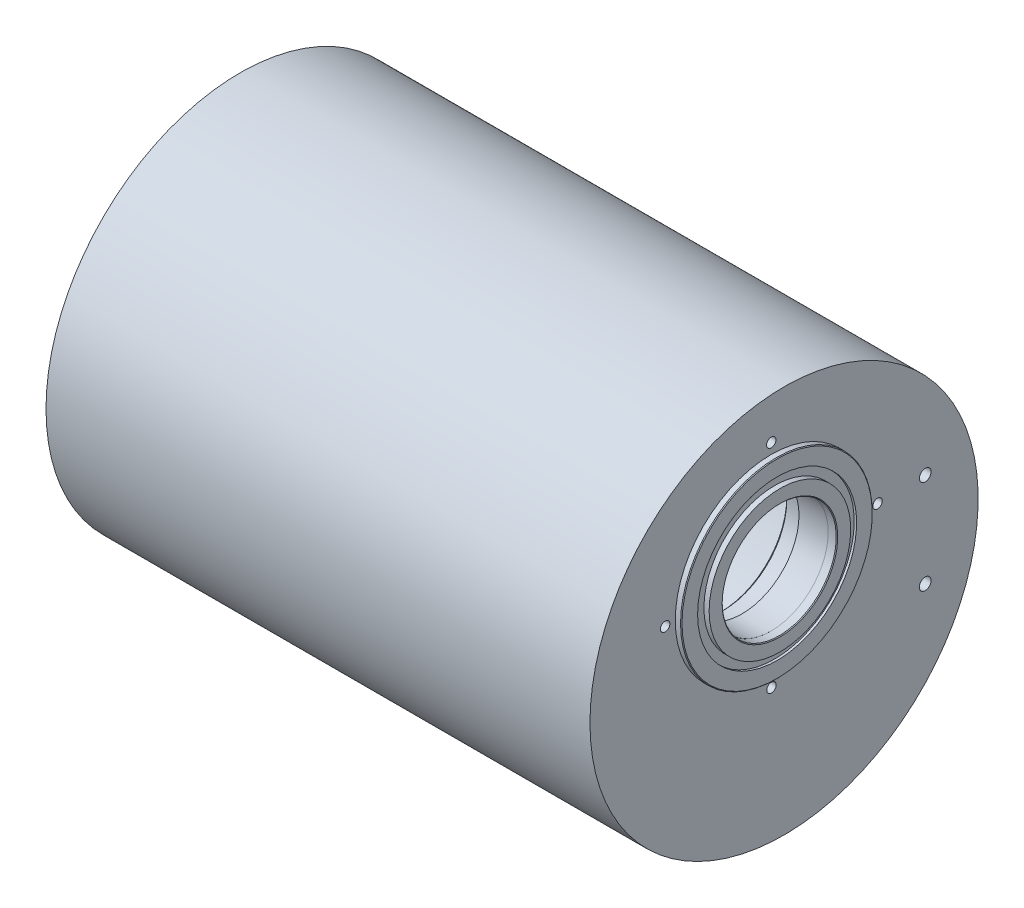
ISO-10303-21;
HEADER;
FILE_DESCRIPTION(('STEP AP214'),'2;1');
FILE_NAME('part.step','',(''),(''),'','','');
FILE_SCHEMA(('AUTOMOTIVE_DESIGN { 1 0 10303 214 1 1 1 1 }'));
ENDSEC;
DATA;
#1=APPLICATION_CONTEXT('core data for automotive mechanical design processes');
#2=APPLICATION_PROTOCOL_DEFINITION('international standard','automotive_design',2000,#1);
#3=PRODUCT_CONTEXT('',#1,'mechanical');
#4=PRODUCT('Part','Part','',(#3));
#5=PRODUCT_RELATED_PRODUCT_CATEGORY('part','',(#4));
#6=PRODUCT_DEFINITION_FORMATION('','',#4);
#7=PRODUCT_DEFINITION_CONTEXT('part definition',#1,'design');
#8=PRODUCT_DEFINITION('design','',#6,#7);
#9=PRODUCT_DEFINITION_SHAPE('','',#8);
#10=(LENGTH_UNIT() NAMED_UNIT(*) SI_UNIT(.MILLI.,.METRE.));
#11=(NAMED_UNIT(*) PLANE_ANGLE_UNIT() SI_UNIT($,.RADIAN.));
#12=(NAMED_UNIT(*) SI_UNIT($,.STERADIAN.) SOLID_ANGLE_UNIT());
#13=UNCERTAINTY_MEASURE_WITH_UNIT(LENGTH_MEASURE(1.E-05),#10,'distance_accuracy_value','');
#14=(GEOMETRIC_REPRESENTATION_CONTEXT(3) GLOBAL_UNCERTAINTY_ASSIGNED_CONTEXT((#13)) GLOBAL_UNIT_ASSIGNED_CONTEXT((#10,
#11,#12)) REPRESENTATION_CONTEXT('',''));
#15=CARTESIAN_POINT('',(0.,0.,0.));
#16=DIRECTION('',(0.,0.,1.));
#17=DIRECTION('',(1.,0.,0.));
#18=AXIS2_PLACEMENT_3D('',#15,#16,#17);
#19=CARTESIAN_POINT('',(101.6,104.775,0.));
#20=DIRECTION('',(1.,0.,0.));
#21=DIRECTION('',(0.,0.,-1.));
#22=AXIS2_PLACEMENT_3D('',#19,#20,#21);
#23=PLANE('',#22);
#24=CARTESIAN_POINT('',(101.6,25.4,-76.2));
#25=DIRECTION('',(1.,0.,0.));
#26=DIRECTION('',(0.,0.,-1.));
#27=AXIS2_PLACEMENT_3D('',#24,#25,#26);
#28=CIRCLE('',#27,3.175);
#29=CARTESIAN_POINT('',(101.6,25.4,-79.375));
#30=VERTEX_POINT('',#29);
#31=EDGE_CURVE('E410',#30,#30,#28,.T.);
#32=ORIENTED_EDGE('',*,*,#31,.F.);
#33=EDGE_LOOP('',(#32));
#34=FACE_BOUND('',#33,.T.);
#35=CARTESIAN_POINT('',(101.6,-25.4,-76.2));
#36=DIRECTION('',(1.,0.,0.));
#37=DIRECTION('',(0.,0.,-1.));
#38=AXIS2_PLACEMENT_3D('',#35,#36,#37);
#39=CIRCLE('',#38,3.175);
#40=CARTESIAN_POINT('',(101.6,-25.4,-79.375));
#41=VERTEX_POINT('',#40);
#42=EDGE_CURVE('E409',#41,#41,#39,.T.);
#43=ORIENTED_EDGE('',*,*,#42,.F.);
#44=EDGE_LOOP('',(#43));
#45=FACE_BOUND('',#44,.T.);
#46=CARTESIAN_POINT('',(101.6,24.9531179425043,-50.4697674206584));
#47=DIRECTION('',(1.,0.,0.));
#48=DIRECTION('',(0.,-1.,0.));
#49=AXIS2_PLACEMENT_3D('',#46,#47,#48);
#50=CIRCLE('',#49,2.54);
#51=CARTESIAN_POINT('',(101.6,22.4131179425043,-50.4697674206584));
#52=VERTEX_POINT('',#51);
#53=EDGE_CURVE('E420',#52,#52,#50,.T.);
#54=ORIENTED_EDGE('',*,*,#53,.F.);
#55=EDGE_LOOP('',(#54));
#56=FACE_BOUND('',#55,.T.);
#57=CARTESIAN_POINT('',(101.6,-32.4357674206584,6.79688205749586));
#58=DIRECTION('',(1.,0.,0.));
#59=DIRECTION('',(0.,0.,1.));
#60=AXIS2_PLACEMENT_3D('',#57,#58,#59);
#61=CIRCLE('',#60,2.54);
#62=CARTESIAN_POINT('',(101.6,-32.4357674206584,9.33688205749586));
#63=VERTEX_POINT('',#62);
#64=EDGE_CURVE('E426',#63,#63,#61,.T.);
#65=ORIENTED_EDGE('',*,*,#64,.F.);
#66=EDGE_LOOP('',(#65));
#67=FACE_BOUND('',#66,.T.);
#68=CARTESIAN_POINT('',(101.6,24.830882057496,64.1857674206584));
#69=DIRECTION('',(1.,0.,0.));
#70=DIRECTION('',(0.,1.,0.));
#71=AXIS2_PLACEMENT_3D('',#68,#69,#70);
#72=CIRCLE('',#71,2.54);
#73=CARTESIAN_POINT('',(101.6,27.370882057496,64.1857674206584));
#74=VERTEX_POINT('',#73);
#75=EDGE_CURVE('E432',#74,#74,#72,.T.);
#76=ORIENTED_EDGE('',*,*,#75,.F.);
#77=EDGE_LOOP('',(#76));
#78=FACE_BOUND('',#77,.T.);
#79=CARTESIAN_POINT('',(101.6,82.2197674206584,6.91911794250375));
#80=DIRECTION('',(1.,0.,0.));
#81=DIRECTION('',(0.,0.,-1.));
#82=AXIS2_PLACEMENT_3D('',#79,#80,#81);
#83=CIRCLE('',#82,2.54);
#84=CARTESIAN_POINT('',(101.6,82.2197674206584,4.37911794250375));
#85=VERTEX_POINT('',#84);
#86=EDGE_CURVE('E438',#85,#85,#83,.T.);
#87=ORIENTED_EDGE('',*,*,#86,.F.);
#88=EDGE_LOOP('',(#87));
#89=FACE_BOUND('',#88,.T.);
#90=CARTESIAN_POINT('',(101.6,0.,0.));
#91=DIRECTION('',(-1.,0.,0.));
#92=DIRECTION('',(0.,0.,1.));
#93=AXIS2_PLACEMENT_3D('',#90,#91,#92);
#94=CIRCLE('',#93,104.775);
#95=CARTESIAN_POINT('',(101.6,0.,104.775));
#96=VERTEX_POINT('',#95);
#97=EDGE_CURVE('E92',#96,#96,#94,.T.);
#98=ORIENTED_EDGE('',*,*,#97,.F.);
#99=EDGE_LOOP('',(#98));
#100=FACE_BOUND('',#99,.T.);
#101=CARTESIAN_POINT('',(101.6,24.892,6.985));
#102=DIRECTION('',(-1.,0.,0.));
#103=DIRECTION('',(0.,0.,1.));
#104=AXIS2_PLACEMENT_3D('',#101,#102,#103);
#105=CIRCLE('',#104,51.7398);
#106=CARTESIAN_POINT('',(101.6,24.892,58.7248));
#107=VERTEX_POINT('',#106);
#108=EDGE_CURVE('E73',#107,#107,#105,.T.);
#109=ORIENTED_EDGE('',*,*,#108,.T.);
#110=EDGE_LOOP('',(#109));
#111=FACE_BOUND('',#110,.T.);
#112=ADVANCED_FACE('F37',(#34,#45,#56,#67,#78,#89,#100,#111),#23,.T.);
#113=CARTESIAN_POINT('',(-141.367260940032,0.,0.));
#114=DIRECTION('',(-1.,0.,0.));
#115=DIRECTION('',(0.,0.,1.));
#116=AXIS2_PLACEMENT_3D('',#113,#114,#115);
#117=CYLINDRICAL_SURFACE('',#116,94.4372);
#118=CARTESIAN_POINT('',(-172.974,0.,0.));
#119=DIRECTION('',(-1.,0.,0.));
#120=DIRECTION('',(0.,0.,1.));
#121=AXIS2_PLACEMENT_3D('',#118,#119,#120);
#122=CIRCLE('',#121,94.4372);
#123=CARTESIAN_POINT('',(-172.974,0.,94.4372));
#124=VERTEX_POINT('',#123);
#125=EDGE_CURVE('E58',#124,#124,#122,.T.);
#126=ORIENTED_EDGE('',*,*,#125,.F.);
#127=EDGE_LOOP('',(#126));
#128=FACE_BOUND('',#127,.T.);
#129=CARTESIAN_POINT('',(-192.024,0.,0.));
#130=DIRECTION('',(-1.,0.,0.));
#131=DIRECTION('',(0.,0.,1.));
#132=AXIS2_PLACEMENT_3D('',#129,#130,#131);
#133=CIRCLE('',#132,94.4372);
#134=CARTESIAN_POINT('',(-192.024,0.,94.4372));
#135=VERTEX_POINT('',#134);
#136=EDGE_CURVE('E70',#135,#135,#133,.T.);
#137=ORIENTED_EDGE('',*,*,#136,.T.);
#138=EDGE_LOOP('',(#137));
#139=FACE_BOUND('',#138,.T.);
#140=ADVANCED_FACE('F39',(#128,#139),#117,.F.);
#141=CARTESIAN_POINT('',(-192.024,104.775,0.));
#142=DIRECTION('',(1.,0.,0.));
#143=DIRECTION('',(0.,0.,-1.));
#144=AXIS2_PLACEMENT_3D('',#141,#142,#143);
#145=PLANE('',#144);
#146=ORIENTED_EDGE('',*,*,#136,.F.);
#147=EDGE_LOOP('',(#146));
#148=FACE_BOUND('',#147,.T.);
#149=CARTESIAN_POINT('',(-192.024,0.,0.));
#150=DIRECTION('',(-1.,0.,0.));
#151=DIRECTION('',(0.,0.,1.));
#152=AXIS2_PLACEMENT_3D('',#149,#150,#151);
#153=CIRCLE('',#152,104.775);
#154=CARTESIAN_POINT('',(-192.024,0.,104.775));
#155=VERTEX_POINT('',#154);
#156=EDGE_CURVE('E95',#155,#155,#153,.T.);
#157=ORIENTED_EDGE('',*,*,#156,.T.);
#158=EDGE_LOOP('',(#157));
#159=FACE_BOUND('',#158,.T.);
#160=ADVANCED_FACE('F155',(#148,#159),#145,.F.);
#161=CARTESIAN_POINT('',(-141.367260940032,0.,0.));
#162=DIRECTION('',(-1.,0.,0.));
#163=DIRECTION('',(0.,0.,1.));
#164=AXIS2_PLACEMENT_3D('',#161,#162,#163);
#165=CYLINDRICAL_SURFACE('',#164,104.775);
#166=ORIENTED_EDGE('',*,*,#97,.T.);
#167=EDGE_LOOP('',(#166));
#168=FACE_BOUND('',#167,.T.);
#169=ORIENTED_EDGE('',*,*,#156,.F.);
#170=EDGE_LOOP('',(#169));
#171=FACE_BOUND('',#170,.T.);
#172=ADVANCED_FACE('F161',(#168,#171),#165,.T.);
#173=CARTESIAN_POINT('',(101.6,24.892,6.985));
#174=DIRECTION('',(-1.,0.,0.));
#175=DIRECTION('',(0.,0.,1.));
#176=AXIS2_PLACEMENT_3D('',#173,#174,#175);
#177=CIRCLE('',#176,30.7975);
#178=CARTESIAN_POINT('',(101.6,-5.9054345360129,6.9215));
#179=VERTEX_POINT('',#178);
#180=CARTESIAN_POINT('',(101.6,55.6894345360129,6.9215));
#181=VERTEX_POINT('',#180);
#182=EDGE_CURVE('E51',#179,#181,#177,.T.);
#183=ORIENTED_EDGE('',*,*,#182,.F.);
#184=CARTESIAN_POINT('',(101.6,24.892,6.858));
#185=DIRECTION('',(1.,0.,0.));
#186=DIRECTION('',(0.,0.,-1.));
#187=AXIS2_PLACEMENT_3D('',#184,#185,#186);
#188=CIRCLE('',#187,30.7975);
#189=EDGE_CURVE('E53',#181,#179,#188,.T.);
#190=ORIENTED_EDGE('',*,*,#189,.F.);
#191=EDGE_LOOP('',(#183,#190));
#192=FACE_BOUND('',#191,.T.);
#193=ADVANCED_FACE('F55',(#192),#23,.T.);
#194=CARTESIAN_POINT('',(74.0156,0.,0.));
#195=DIRECTION('',(-1.,0.,0.));
#196=DIRECTION('',(0.,0.,1.));
#197=AXIS2_PLACEMENT_3D('',#194,#195,#196);
#198=PLANE('',#197);
#199=CARTESIAN_POINT('',(74.0156,0.,0.));
#200=DIRECTION('',(-1.,0.,0.));
#201=DIRECTION('',(0.,0.,1.));
#202=AXIS2_PLACEMENT_3D('',#199,#200,#201);
#203=CIRCLE('',#202,91.694);
#204=CARTESIAN_POINT('',(74.0156,0.,91.694));
#205=VERTEX_POINT('',#204);
#206=EDGE_CURVE('E111',#205,#205,#203,.T.);
#207=ORIENTED_EDGE('',*,*,#206,.T.);
#208=EDGE_LOOP('',(#207));
#209=FACE_BOUND('',#208,.T.);
#210=CARTESIAN_POINT('',(74.0156,24.892,6.858));
#211=DIRECTION('',(-1.,0.,0.));
#212=DIRECTION('',(0.,0.,1.));
#213=AXIS2_PLACEMENT_3D('',#210,#211,#212);
#214=CIRCLE('',#213,36.298340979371);
#215=CARTESIAN_POINT('',(74.0156,24.892,43.1563409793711));
#216=VERTEX_POINT('',#215);
#217=EDGE_CURVE('E108',#216,#216,#214,.F.);
#218=ORIENTED_EDGE('',*,*,#217,.T.);
#219=EDGE_LOOP('',(#218));
#220=FACE_BOUND('',#219,.T.);
#221=ADVANCED_FACE('F127',(#209,#220),#198,.T.);
#222=CARTESIAN_POINT('',(-141.367260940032,0.,0.));
#223=DIRECTION('',(-1.,0.,0.));
#224=DIRECTION('',(0.,0.,1.));
#225=AXIS2_PLACEMENT_3D('',#222,#223,#224);
#226=CYLINDRICAL_SURFACE('',#225,92.71);
#227=CARTESIAN_POINT('',(72.9996,0.,0.));
#228=DIRECTION('',(-1.,0.,0.));
#229=DIRECTION('',(0.,0.,1.));
#230=AXIS2_PLACEMENT_3D('',#227,#228,#229);
#231=CIRCLE('',#230,92.71);
#232=CARTESIAN_POINT('',(72.9996,0.,92.71));
#233=VERTEX_POINT('',#232);
#234=EDGE_CURVE('E45',#233,#233,#231,.F.);
#235=ORIENTED_EDGE('',*,*,#234,.T.);
#236=EDGE_LOOP('',(#235));
#237=FACE_BOUND('',#236,.T.);
#238=CARTESIAN_POINT('',(-172.974,0.,0.));
#239=DIRECTION('',(-1.,0.,0.));
#240=DIRECTION('',(0.,0.,1.));
#241=AXIS2_PLACEMENT_3D('',#238,#239,#240);
#242=CIRCLE('',#241,92.71);
#243=CARTESIAN_POINT('',(-172.974,0.,92.71));
#244=VERTEX_POINT('',#243);
#245=EDGE_CURVE('E89',#244,#244,#242,.T.);
#246=ORIENTED_EDGE('',*,*,#245,.T.);
#247=EDGE_LOOP('',(#246));
#248=FACE_BOUND('',#247,.T.);
#249=ADVANCED_FACE('F116',(#237,#248),#226,.F.);
#250=CARTESIAN_POINT('',(-172.974,94.4372,0.));
#251=DIRECTION('',(1.,0.,0.));
#252=DIRECTION('',(0.,0.,-1.));
#253=AXIS2_PLACEMENT_3D('',#250,#251,#252);
#254=PLANE('',#253);
#255=ORIENTED_EDGE('',*,*,#245,.F.);
#256=EDGE_LOOP('',(#255));
#257=FACE_BOUND('',#256,.T.);
#258=ORIENTED_EDGE('',*,*,#125,.T.);
#259=EDGE_LOOP('',(#258));
#260=FACE_BOUND('',#259,.T.);
#261=ADVANCED_FACE('F204',(#257,#260),#254,.F.);
#262=CARTESIAN_POINT('',(85.725,24.892,6.858));
#263=DIRECTION('',(1.,0.,0.));
#264=DIRECTION('',(0.,0.,-1.));
#265=AXIS2_PLACEMENT_3D('',#262,#263,#264);
#266=CYLINDRICAL_SURFACE('',#265,30.7975);
#267=CARTESIAN_POINT('',(85.725,24.892,6.858));
#268=DIRECTION('',(1.,0.,0.));
#269=DIRECTION('',(0.,0.,-1.));
#270=AXIS2_PLACEMENT_3D('',#267,#268,#269);
#271=CIRCLE('',#270,30.7975);
#272=CARTESIAN_POINT('',(85.725,24.892,-23.9395));
#273=VERTEX_POINT('',#272);
#274=EDGE_CURVE('E65',#273,#273,#271,.F.);
#275=ORIENTED_EDGE('',*,*,#274,.T.);
#276=EDGE_LOOP('',(#275));
#277=FACE_BOUND('',#276,.T.);
#278=ORIENTED_EDGE('',*,*,#189,.T.);
#279=EDGE_CURVE('E59',#179,#181,#188,.T.);
#280=ORIENTED_EDGE('',*,*,#279,.T.);
#281=EDGE_LOOP('',(#278,#280));
#282=FACE_BOUND('',#281,.T.);
#283=ADVANCED_FACE('F61',(#277,#282),#266,.F.);
#284=CARTESIAN_POINT('',(85.725,24.892,6.858));
#285=DIRECTION('',(1.,0.,0.));
#286=DIRECTION('',(0.,0.,-1.));
#287=AXIS2_PLACEMENT_3D('',#284,#285,#286);
#288=PLANE('',#287);
#289=CARTESIAN_POINT('',(85.725,24.892,6.858));
#290=DIRECTION('',(1.,0.,0.));
#291=DIRECTION('',(0.,0.,-1.));
#292=AXIS2_PLACEMENT_3D('',#289,#290,#291);
#293=CIRCLE('',#292,32.7025);
#294=CARTESIAN_POINT('',(85.725,24.892,-25.8445));
#295=VERTEX_POINT('',#294);
#296=EDGE_CURVE('E102',#295,#295,#293,.F.);
#297=ORIENTED_EDGE('',*,*,#296,.T.);
#298=EDGE_LOOP('',(#297));
#299=FACE_BOUND('',#298,.T.);
#300=ORIENTED_EDGE('',*,*,#274,.F.);
#301=EDGE_LOOP('',(#300));
#302=FACE_BOUND('',#301,.T.);
#303=ADVANCED_FACE('F195',(#299,#302),#288,.F.);
#304=CARTESIAN_POINT('',(-192.024,24.892,6.858));
#305=DIRECTION('',(1.,0.,0.));
#306=DIRECTION('',(0.,0.,-1.));
#307=AXIS2_PLACEMENT_3D('',#304,#305,#306);
#308=CYLINDRICAL_SURFACE('',#307,34.29);
#309=CARTESIAN_POINT('',(75.6031,24.892,6.858));
#310=DIRECTION('',(-1.,0.,0.));
#311=DIRECTION('',(0.,0.,1.));
#312=AXIS2_PLACEMENT_3D('',#309,#310,#311);
#313=CIRCLE('',#312,34.29);
#314=CARTESIAN_POINT('',(75.6031,24.892,41.148));
#315=VERTEX_POINT('',#314);
#316=EDGE_CURVE('E105',#315,#315,#313,.T.);
#317=ORIENTED_EDGE('',*,*,#316,.T.);
#318=EDGE_LOOP('',(#317));
#319=FACE_BOUND('',#318,.T.);
#320=CARTESIAN_POINT('',(84.1375,24.892,6.858));
#321=DIRECTION('',(1.,0.,0.));
#322=DIRECTION('',(0.,0.,-1.));
#323=AXIS2_PLACEMENT_3D('',#320,#321,#322);
#324=CIRCLE('',#323,34.29);
#325=CARTESIAN_POINT('',(84.1375,24.892,-27.432));
#326=VERTEX_POINT('',#325);
#327=EDGE_CURVE('E69',#326,#326,#324,.T.);
#328=ORIENTED_EDGE('',*,*,#327,.T.);
#329=EDGE_LOOP('',(#328));
#330=FACE_BOUND('',#329,.T.);
#331=ADVANCED_FACE('F191',(#319,#330),#308,.F.);
#332=CARTESIAN_POINT('',(101.6,55.6895,6.985));
#333=DIRECTION('',(-1.,0.,0.));
#334=DIRECTION('',(0.,0.,1.));
#335=AXIS2_PLACEMENT_3D('',#332,#333,#334);
#336=PLANE('',#335);
#337=ORIENTED_EDGE('',*,*,#279,.F.);
#338=EDGE_CURVE('E68',#181,#179,#177,.T.);
#339=ORIENTED_EDGE('',*,*,#338,.F.);
#340=EDGE_LOOP('',(#337,#339));
#341=FACE_BOUND('',#340,.T.);
#342=ADVANCED_FACE('F72',(#341),#336,.T.);
#343=CARTESIAN_POINT('',(104.441625,24.892,6.985));
#344=DIRECTION('',(-1.,0.,0.));
#345=DIRECTION('',(0.,0.,1.));
#346=AXIS2_PLACEMENT_3D('',#343,#344,#345);
#347=CONICAL_SURFACE('',#346,51.7398,0.785398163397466);
#348=CARTESIAN_POINT('',(104.8385,24.892,6.985));
#349=DIRECTION('',(-1.,0.,0.));
#350=DIRECTION('',(0.,0.,1.));
#351=AXIS2_PLACEMENT_3D('',#348,#349,#350);
#352=CIRCLE('',#351,51.342925);
#353=CARTESIAN_POINT('',(104.8385,24.892,58.327925));
#354=VERTEX_POINT('',#353);
#355=EDGE_CURVE('E444',#354,#354,#352,.T.);
#356=ORIENTED_EDGE('',*,*,#355,.T.);
#357=EDGE_LOOP('',(#356));
#358=FACE_BOUND('',#357,.T.);
#359=CARTESIAN_POINT('',(104.441625,24.892,6.985));
#360=DIRECTION('',(-1.,0.,0.));
#361=DIRECTION('',(0.,0.,1.));
#362=AXIS2_PLACEMENT_3D('',#359,#360,#361);
#363=CIRCLE('',#362,51.7398);
#364=CARTESIAN_POINT('',(104.441625,24.892,58.7248));
#365=VERTEX_POINT('',#364);
#366=EDGE_CURVE('E76',#365,#365,#363,.T.);
#367=ORIENTED_EDGE('',*,*,#366,.F.);
#368=EDGE_LOOP('',(#367));
#369=FACE_BOUND('',#368,.T.);
#370=ADVANCED_FACE('F181',(#358,#369),#347,.T.);
#371=CARTESIAN_POINT('',(101.6,24.892,6.985));
#372=DIRECTION('',(-1.,0.,0.));
#373=DIRECTION('',(0.,0.,1.));
#374=AXIS2_PLACEMENT_3D('',#371,#372,#373);
#375=CYLINDRICAL_SURFACE('',#374,51.7398);
#376=ORIENTED_EDGE('',*,*,#108,.F.);
#377=EDGE_LOOP('',(#376));
#378=FACE_BOUND('',#377,.T.);
#379=ORIENTED_EDGE('',*,*,#366,.T.);
#380=EDGE_LOOP('',(#379));
#381=FACE_BOUND('',#380,.T.);
#382=ADVANCED_FACE('F178',(#378,#381),#375,.T.);
#383=CARTESIAN_POINT('',(101.6,24.892,6.985));
#384=DIRECTION('',(-1.,0.,0.));
#385=DIRECTION('',(0.,0.,1.));
#386=AXIS2_PLACEMENT_3D('',#383,#384,#385);
#387=CYLINDRICAL_SURFACE('',#386,30.7975);
#388=CARTESIAN_POINT('',(105.965625,24.892,6.985));
#389=DIRECTION('',(-1.,0.,0.));
#390=DIRECTION('',(0.,0.,1.));
#391=AXIS2_PLACEMENT_3D('',#388,#389,#390);
#392=CIRCLE('',#391,30.7975);
#393=CARTESIAN_POINT('',(105.965625,24.892,37.7825));
#394=VERTEX_POINT('',#393);
#395=EDGE_CURVE('E74',#394,#394,#392,.T.);
#396=ORIENTED_EDGE('',*,*,#395,.F.);
#397=EDGE_LOOP('',(#396));
#398=FACE_BOUND('',#397,.T.);
#399=ORIENTED_EDGE('',*,*,#338,.T.);
#400=ORIENTED_EDGE('',*,*,#182,.T.);
#401=EDGE_LOOP('',(#399,#400));
#402=FACE_BOUND('',#401,.T.);
#403=ADVANCED_FACE('F67',(#398,#402),#387,.F.);
#404=CARTESIAN_POINT('',(105.965625,24.892,6.985));
#405=DIRECTION('',(1.,0.,0.));
#406=DIRECTION('',(0.,0.,-1.));
#407=AXIS2_PLACEMENT_3D('',#404,#405,#406);
#408=CONICAL_SURFACE('',#407,30.7975,0.785398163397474);
#409=CARTESIAN_POINT('',(106.3625,24.892,6.985));
#410=DIRECTION('',(-1.,0.,0.));
#411=DIRECTION('',(0.,0.,1.));
#412=AXIS2_PLACEMENT_3D('',#409,#410,#411);
#413=CIRCLE('',#412,31.194375);
#414=CARTESIAN_POINT('',(106.3625,24.892,38.179375));
#415=VERTEX_POINT('',#414);
#416=EDGE_CURVE('E79',#415,#415,#413,.T.);
#417=ORIENTED_EDGE('',*,*,#416,.F.);
#418=EDGE_LOOP('',(#417));
#419=FACE_BOUND('',#418,.T.);
#420=ORIENTED_EDGE('',*,*,#395,.T.);
#421=EDGE_LOOP('',(#420));
#422=FACE_BOUND('',#421,.T.);
#423=ADVANCED_FACE('F249',(#419,#422),#408,.F.);
#424=CARTESIAN_POINT('',(106.3625,56.086375,6.985));
#425=DIRECTION('',(-1.,0.,0.));
#426=DIRECTION('',(0.,0.,1.));
#427=AXIS2_PLACEMENT_3D('',#424,#425,#426);
#428=PLANE('',#427);
#429=CARTESIAN_POINT('',(106.3625,24.892,6.985));
#430=DIRECTION('',(-1.,0.,0.));
#431=DIRECTION('',(0.,0.,1.));
#432=AXIS2_PLACEMENT_3D('',#429,#430,#431);
#433=CIRCLE('',#432,38.227);
#434=CARTESIAN_POINT('',(106.3625,24.892,45.212));
#435=VERTEX_POINT('',#434);
#436=EDGE_CURVE('E455',#435,#435,#433,.T.);
#437=ORIENTED_EDGE('',*,*,#436,.F.);
#438=EDGE_LOOP('',(#437));
#439=FACE_BOUND('',#438,.T.);
#440=ORIENTED_EDGE('',*,*,#416,.T.);
#441=EDGE_LOOP('',(#440));
#442=FACE_BOUND('',#441,.T.);
#443=ADVANCED_FACE('F257',(#439,#442),#428,.F.);
#444=CARTESIAN_POINT('',(101.6,24.892,6.985));
#445=DIRECTION('',(-1.,0.,0.));
#446=DIRECTION('',(0.,0.,1.));
#447=AXIS2_PLACEMENT_3D('',#444,#445,#446);
#448=CYLINDRICAL_SURFACE('',#447,38.227);
#449=CARTESIAN_POINT('',(103.5431,24.892,6.985));
#450=DIRECTION('',(-1.,0.,0.));
#451=DIRECTION('',(0.,0.,1.));
#452=AXIS2_PLACEMENT_3D('',#449,#450,#451);
#453=CIRCLE('',#452,38.227);
#454=CARTESIAN_POINT('',(103.5431,24.892,45.212));
#455=VERTEX_POINT('',#454);
#456=EDGE_CURVE('E452',#455,#455,#453,.T.);
#457=ORIENTED_EDGE('',*,*,#456,.F.);
#458=EDGE_LOOP('',(#457));
#459=FACE_BOUND('',#458,.T.);
#460=ORIENTED_EDGE('',*,*,#436,.T.);
#461=EDGE_LOOP('',(#460));
#462=FACE_BOUND('',#461,.T.);
#463=ADVANCED_FACE('F265',(#459,#462),#448,.T.);
#464=CARTESIAN_POINT('',(103.5431,63.119,6.985));
#465=DIRECTION('',(-1.,0.,0.));
#466=DIRECTION('',(0.,0.,1.));
#467=AXIS2_PLACEMENT_3D('',#464,#465,#466);
#468=PLANE('',#467);
#469=CARTESIAN_POINT('',(103.5431,24.892,6.985));
#470=DIRECTION('',(-1.,0.,0.));
#471=DIRECTION('',(0.,0.,1.));
#472=AXIS2_PLACEMENT_3D('',#469,#470,#471);
#473=CIRCLE('',#472,42.926);
#474=CARTESIAN_POINT('',(103.5431,24.892,49.911));
#475=VERTEX_POINT('',#474);
#476=EDGE_CURVE('E449',#475,#475,#473,.T.);
#477=ORIENTED_EDGE('',*,*,#476,.F.);
#478=EDGE_LOOP('',(#477));
#479=FACE_BOUND('',#478,.T.);
#480=ORIENTED_EDGE('',*,*,#456,.T.);
#481=EDGE_LOOP('',(#480));
#482=FACE_BOUND('',#481,.T.);
#483=ADVANCED_FACE('F273',(#479,#482),#468,.F.);
#484=CARTESIAN_POINT('',(101.6,24.892,6.985));
#485=DIRECTION('',(-1.,0.,0.));
#486=DIRECTION('',(0.,0.,1.));
#487=AXIS2_PLACEMENT_3D('',#484,#485,#486);
#488=CYLINDRICAL_SURFACE('',#487,42.926);
#489=CARTESIAN_POINT('',(104.8385,24.892,6.985));
#490=DIRECTION('',(-1.,0.,0.));
#491=DIRECTION('',(0.,0.,1.));
#492=AXIS2_PLACEMENT_3D('',#489,#490,#491);
#493=CIRCLE('',#492,42.926);
#494=CARTESIAN_POINT('',(104.8385,24.892,49.911));
#495=VERTEX_POINT('',#494);
#496=EDGE_CURVE('E446',#495,#495,#493,.T.);
#497=ORIENTED_EDGE('',*,*,#496,.F.);
#498=EDGE_LOOP('',(#497));
#499=FACE_BOUND('',#498,.T.);
#500=ORIENTED_EDGE('',*,*,#476,.T.);
#501=EDGE_LOOP('',(#500));
#502=FACE_BOUND('',#501,.T.);
#503=ADVANCED_FACE('F281',(#499,#502),#488,.F.);
#504=CARTESIAN_POINT('',(104.8385,67.818,6.985));
#505=DIRECTION('',(-1.,0.,0.));
#506=DIRECTION('',(0.,0.,1.));
#507=AXIS2_PLACEMENT_3D('',#504,#505,#506);
#508=PLANE('',#507);
#509=ORIENTED_EDGE('',*,*,#355,.F.);
#510=EDGE_LOOP('',(#509));
#511=FACE_BOUND('',#510,.T.);
#512=ORIENTED_EDGE('',*,*,#496,.T.);
#513=EDGE_LOOP('',(#512));
#514=FACE_BOUND('',#513,.T.);
#515=ADVANCED_FACE('F289',(#511,#514),#508,.F.);
#516=CARTESIAN_POINT('',(84.1375,24.892,6.858));
#517=DIRECTION('',(1.,0.,0.));
#518=DIRECTION('',(0.,0.,-1.));
#519=AXIS2_PLACEMENT_3D('',#516,#517,#518);
#520=TOROIDAL_SURFACE('',#519,32.7025,1.5875);
#521=ORIENTED_EDGE('',*,*,#296,.F.);
#522=EDGE_LOOP('',(#521));
#523=FACE_BOUND('',#522,.T.);
#524=ORIENTED_EDGE('',*,*,#327,.F.);
#525=EDGE_LOOP('',(#524));
#526=FACE_BOUND('',#525,.T.);
#527=ADVANCED_FACE('F297',(#523,#526),#520,.F.);
#528=CARTESIAN_POINT('',(75.6031,24.892,6.858));
#529=DIRECTION('',(-1.,0.,0.));
#530=DIRECTION('',(0.,0.,1.));
#531=AXIS2_PLACEMENT_3D('',#528,#529,#530);
#532=CONICAL_SURFACE('',#531,34.29,0.785398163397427);
#533=CARTESIAN_POINT('',(74.3131795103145,24.892,6.858));
#534=DIRECTION('',(1.,0.,0.));
#535=DIRECTION('',(0.,0.,-1.));
#536=AXIS2_PLACEMENT_3D('',#533,#534,#535);
#537=CIRCLE('',#536,35.5799204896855);
#538=CARTESIAN_POINT('',(74.3131795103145,24.892,-28.7219204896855));
#539=VERTEX_POINT('',#538);
#540=EDGE_CURVE('E11',#539,#539,#537,.F.);
#541=ORIENTED_EDGE('',*,*,#540,.T.);
#542=EDGE_LOOP('',(#541));
#543=FACE_BOUND('',#542,.T.);
#544=ORIENTED_EDGE('',*,*,#316,.F.);
#545=EDGE_LOOP('',(#544));
#546=FACE_BOUND('',#545,.T.);
#547=ADVANCED_FACE('F123',(#543,#546),#532,.F.);
#548=CARTESIAN_POINT('',(72.9996,0.,0.));
#549=DIRECTION('',(-1.,0.,0.));
#550=DIRECTION('',(0.,0.,1.));
#551=AXIS2_PLACEMENT_3D('',#548,#549,#550);
#552=TOROIDAL_SURFACE('',#551,91.694,1.016);
#553=ORIENTED_EDGE('',*,*,#234,.F.);
#554=EDGE_LOOP('',(#553));
#555=FACE_BOUND('',#554,.T.);
#556=ORIENTED_EDGE('',*,*,#206,.F.);
#557=EDGE_LOOP('',(#556));
#558=FACE_BOUND('',#557,.T.);
#559=ADVANCED_FACE('F119',(#555,#558),#552,.F.);
#560=CARTESIAN_POINT('',(75.0316,24.892,6.858));
#561=DIRECTION('',(-1.,0.,0.));
#562=DIRECTION('',(0.,0.,1.));
#563=AXIS2_PLACEMENT_3D('',#560,#561,#562);
#564=TOROIDAL_SURFACE('',#563,36.298340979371,1.016);
#565=ORIENTED_EDGE('',*,*,#540,.F.);
#566=EDGE_LOOP('',(#565));
#567=FACE_BOUND('',#566,.T.);
#568=ORIENTED_EDGE('',*,*,#217,.F.);
#569=EDGE_LOOP('',(#568));
#570=FACE_BOUND('',#569,.T.);
#571=ADVANCED_FACE('F122',(#567,#570),#564,.T.);
#572=CARTESIAN_POINT('',(92.075,82.2197674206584,6.91911794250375));
#573=DIRECTION('',(1.,0.,0.));
#574=DIRECTION('',(0.,0.,-1.));
#575=AXIS2_PLACEMENT_3D('',#572,#573,#574);
#576=CYLINDRICAL_SURFACE('',#575,2.54);
#577=CARTESIAN_POINT('',(92.075,82.2197674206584,6.91911794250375));
#578=DIRECTION('',(1.,0.,0.));
#579=DIRECTION('',(0.,0.,-1.));
#580=AXIS2_PLACEMENT_3D('',#577,#578,#579);
#581=CIRCLE('',#580,2.54);
#582=CARTESIAN_POINT('',(92.075,82.2197674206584,4.37911794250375));
#583=VERTEX_POINT('',#582);
#584=EDGE_CURVE('E441',#583,#583,#581,.T.);
#585=CARTESIAN_POINT('',(92.075,82.2197674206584,4.37911794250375));
#586=CARTESIAN_POINT('',(92.17421875,82.2197674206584,4.37911794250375));
#587=CARTESIAN_POINT('',(92.2734375,82.2197674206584,4.37911794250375));
#588=CARTESIAN_POINT('',(92.471875,82.2197674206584,4.37911794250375));
#589=CARTESIAN_POINT('',(92.57109375,82.2197674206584,4.37911794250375));
#590=CARTESIAN_POINT('',(92.76953125,82.2197674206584,4.37911794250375));
#591=CARTESIAN_POINT('',(92.86875,82.2197674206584,4.37911794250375));
#592=CARTESIAN_POINT('',(93.0671875,82.2197674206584,4.37911794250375));
#593=CARTESIAN_POINT('',(93.16640625,82.2197674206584,4.37911794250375));
#594=CARTESIAN_POINT('',(93.36484375,82.2197674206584,4.37911794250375));
#595=CARTESIAN_POINT('',(93.4640625,82.2197674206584,4.37911794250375));
#596=CARTESIAN_POINT('',(93.6625,82.2197674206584,4.37911794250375));
#597=CARTESIAN_POINT('',(93.76171875,82.2197674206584,4.37911794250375));
#598=CARTESIAN_POINT('',(93.96015625,82.2197674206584,4.37911794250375));
#599=CARTESIAN_POINT('',(94.059375,82.2197674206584,4.37911794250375));
#600=CARTESIAN_POINT('',(94.2578125,82.2197674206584,4.37911794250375));
#601=CARTESIAN_POINT('',(94.35703125,82.2197674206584,4.37911794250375));
#602=CARTESIAN_POINT('',(94.55546875,82.2197674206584,4.37911794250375));
#603=CARTESIAN_POINT('',(94.6546875,82.2197674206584,4.37911794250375));
#604=CARTESIAN_POINT('',(94.853125,82.2197674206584,4.37911794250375));
#605=CARTESIAN_POINT('',(94.95234375,82.2197674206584,4.37911794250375));
#606=CARTESIAN_POINT('',(95.15078125,82.2197674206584,4.37911794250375));
#607=CARTESIAN_POINT('',(95.25,82.2197674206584,4.37911794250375));
#608=CARTESIAN_POINT('',(95.4484375,82.2197674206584,4.37911794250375));
#609=CARTESIAN_POINT('',(95.54765625,82.2197674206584,4.37911794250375));
#610=CARTESIAN_POINT('',(95.74609375,82.2197674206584,4.37911794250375));
#611=CARTESIAN_POINT('',(95.8453125,82.2197674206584,4.37911794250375));
#612=CARTESIAN_POINT('',(96.04375,82.2197674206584,4.37911794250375));
#613=CARTESIAN_POINT('',(96.14296875,82.2197674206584,4.37911794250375));
#614=CARTESIAN_POINT('',(96.34140625,82.2197674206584,4.37911794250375));
#615=CARTESIAN_POINT('',(96.440625,82.2197674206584,4.37911794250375));
#616=CARTESIAN_POINT('',(96.6390625,82.2197674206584,4.37911794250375));
#617=CARTESIAN_POINT('',(96.73828125,82.2197674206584,4.37911794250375));
#618=CARTESIAN_POINT('',(96.93671875,82.2197674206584,4.37911794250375));
#619=CARTESIAN_POINT('',(97.0359375,82.2197674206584,4.37911794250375));
#620=CARTESIAN_POINT('',(97.234375,82.2197674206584,4.37911794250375));
#621=CARTESIAN_POINT('',(97.33359375,82.2197674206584,4.37911794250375));
#622=CARTESIAN_POINT('',(97.53203125,82.2197674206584,4.37911794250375));
#623=CARTESIAN_POINT('',(97.63125,82.2197674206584,4.37911794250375));
#624=CARTESIAN_POINT('',(97.8296875,82.2197674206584,4.37911794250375));
#625=CARTESIAN_POINT('',(97.92890625,82.2197674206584,4.37911794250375));
#626=CARTESIAN_POINT('',(98.12734375,82.2197674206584,4.37911794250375));
#627=CARTESIAN_POINT('',(98.2265625,82.2197674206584,4.37911794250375));
#628=CARTESIAN_POINT('',(98.425,82.2197674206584,4.37911794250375));
#629=CARTESIAN_POINT('',(98.52421875,82.2197674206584,4.37911794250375));
#630=CARTESIAN_POINT('',(98.72265625,82.2197674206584,4.37911794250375));
#631=CARTESIAN_POINT('',(98.821875,82.2197674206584,4.37911794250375));
#632=CARTESIAN_POINT('',(99.0203125,82.2197674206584,4.37911794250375));
#633=CARTESIAN_POINT('',(99.11953125,82.2197674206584,4.37911794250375));
#634=CARTESIAN_POINT('',(99.31796875,82.2197674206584,4.37911794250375));
#635=CARTESIAN_POINT('',(99.4171875,82.2197674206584,4.37911794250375));
#636=CARTESIAN_POINT('',(99.615625,82.2197674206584,4.37911794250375));
#637=CARTESIAN_POINT('',(99.71484375,82.2197674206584,4.37911794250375));
#638=CARTESIAN_POINT('',(99.91328125,82.2197674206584,4.37911794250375));
#639=CARTESIAN_POINT('',(100.0125,82.2197674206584,4.37911794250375));
#640=CARTESIAN_POINT('',(100.2109375,82.2197674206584,4.37911794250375));
#641=CARTESIAN_POINT('',(100.31015625,82.2197674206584,4.37911794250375));
#642=CARTESIAN_POINT('',(100.50859375,82.2197674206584,4.37911794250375));
#643=CARTESIAN_POINT('',(100.6078125,82.2197674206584,4.37911794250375));
#644=CARTESIAN_POINT('',(100.80625,82.2197674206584,4.37911794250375));
#645=CARTESIAN_POINT('',(100.90546875,82.2197674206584,4.37911794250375));
#646=CARTESIAN_POINT('',(101.10390625,82.2197674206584,4.37911794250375));
#647=CARTESIAN_POINT('',(101.203125,82.2197674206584,4.37911794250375));
#648=CARTESIAN_POINT('',(101.4015625,82.2197674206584,4.37911794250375));
#649=CARTESIAN_POINT('',(101.50078125,82.2197674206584,4.37911794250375));
#650=CARTESIAN_POINT('',(101.6,82.2197674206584,4.37911794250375));
#651=B_SPLINE_CURVE_WITH_KNOTS('',3,(#585,#586,#587,#588,#589,#590,#591,#592,#593,#594,#595,
#596,#597,#598,#599,#600,#601,#602,#603,#604,#605,#606,#607,#608,#609,#610,#611,#612,#613,#614,
#615,#616,#617,#618,#619,#620,#621,#622,#623,#624,#625,#626,#627,#628,#629,#630,#631,#632,#633,
#634,#635,#636,#637,#638,#639,#640,#641,#642,#643,#644,#645,#646,#647,#648,#649,#650),
.UNSPECIFIED.,.F.,.F.,(4,2,2,2,2,2,2,2,2,2,2,2,2,2,2,2,2,2,2,2,2,2,2,2,2,2,2,2,2,2,2,2,4),(0.,
0.297656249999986,0.595312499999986,0.892968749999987,1.19062499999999,1.48828124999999,
1.78593749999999,2.08359374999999,2.38124999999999,2.67890624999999,2.97656249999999,
3.27421874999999,3.57187499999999,3.86953124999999,4.16718749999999,4.46484374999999,
4.76249999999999,5.06015624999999,5.35781249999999,5.65546874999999,5.95312499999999,
6.25078124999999,6.54843749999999,6.84609374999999,7.14374999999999,7.44140624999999,
7.73906249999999,8.03671874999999,8.33437499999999,8.63203124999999,8.92968749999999,
9.22734374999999,9.52499999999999),.UNSPECIFIED.);
#652=EDGE_CURVE('BSEAM134',#583,#85,#651,.T.);
#653=ORIENTED_EDGE('',*,*,#584,.F.);
#654=ORIENTED_EDGE('',*,*,#86,.T.);
#655=ORIENTED_EDGE('',*,*,#652,.T.);
#656=ORIENTED_EDGE('',*,*,#652,.F.);
#657=EDGE_LOOP('',(#653,#655,#654,#656));
#658=FACE_BOUND('',#657,.T.);
#659=ADVANCED_FACE('F134',(#658),#576,.F.);
#660=CARTESIAN_POINT('',(92.075,82.2197674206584,6.91911794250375));
#661=DIRECTION('',(1.,0.,0.));
#662=DIRECTION('',(0.,0.,-1.));
#663=AXIS2_PLACEMENT_3D('',#660,#661,#662);
#664=PLANE('',#663);
#665=ORIENTED_EDGE('',*,*,#584,.T.);
#666=EDGE_LOOP('',(#665));
#667=FACE_BOUND('',#666,.T.);
#668=ADVANCED_FACE('F137',(#667),#664,.T.);
#669=CARTESIAN_POINT('',(92.075,24.830882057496,64.1857674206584));
#670=DIRECTION('',(1.,0.,0.));
#671=DIRECTION('',(0.,1.,0.));
#672=AXIS2_PLACEMENT_3D('',#669,#670,#671);
#673=CYLINDRICAL_SURFACE('',#672,2.54);
#674=CARTESIAN_POINT('',(92.075,24.830882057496,64.1857674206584));
#675=DIRECTION('',(1.,0.,0.));
#676=DIRECTION('',(0.,1.,0.));
#677=AXIS2_PLACEMENT_3D('',#674,#675,#676);
#678=CIRCLE('',#677,2.54);
#679=CARTESIAN_POINT('',(92.075,27.370882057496,64.1857674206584));
#680=VERTEX_POINT('',#679);
#681=EDGE_CURVE('E435',#680,#680,#678,.T.);
#682=CARTESIAN_POINT('',(92.075,27.370882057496,64.1857674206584));
#683=CARTESIAN_POINT('',(92.17421875,27.370882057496,64.1857674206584));
#684=CARTESIAN_POINT('',(92.2734375,27.370882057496,64.1857674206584));
#685=CARTESIAN_POINT('',(92.471875,27.370882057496,64.1857674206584));
#686=CARTESIAN_POINT('',(92.57109375,27.370882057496,64.1857674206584));
#687=CARTESIAN_POINT('',(92.76953125,27.370882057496,64.1857674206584));
#688=CARTESIAN_POINT('',(92.86875,27.370882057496,64.1857674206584));
#689=CARTESIAN_POINT('',(93.0671875,27.370882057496,64.1857674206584));
#690=CARTESIAN_POINT('',(93.16640625,27.370882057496,64.1857674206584));
#691=CARTESIAN_POINT('',(93.36484375,27.370882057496,64.1857674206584));
#692=CARTESIAN_POINT('',(93.4640625,27.370882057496,64.1857674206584));
#693=CARTESIAN_POINT('',(93.6625,27.370882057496,64.1857674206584));
#694=CARTESIAN_POINT('',(93.76171875,27.370882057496,64.1857674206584));
#695=CARTESIAN_POINT('',(93.96015625,27.370882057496,64.1857674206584));
#696=CARTESIAN_POINT('',(94.059375,27.370882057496,64.1857674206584));
#697=CARTESIAN_POINT('',(94.2578125,27.370882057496,64.1857674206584));
#698=CARTESIAN_POINT('',(94.35703125,27.370882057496,64.1857674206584));
#699=CARTESIAN_POINT('',(94.55546875,27.370882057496,64.1857674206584));
#700=CARTESIAN_POINT('',(94.6546875,27.370882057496,64.1857674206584));
#701=CARTESIAN_POINT('',(94.853125,27.370882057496,64.1857674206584));
#702=CARTESIAN_POINT('',(94.95234375,27.370882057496,64.1857674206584));
#703=CARTESIAN_POINT('',(95.15078125,27.370882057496,64.1857674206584));
#704=CARTESIAN_POINT('',(95.25,27.370882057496,64.1857674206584));
#705=CARTESIAN_POINT('',(95.4484375,27.370882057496,64.1857674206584));
#706=CARTESIAN_POINT('',(95.54765625,27.370882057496,64.1857674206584));
#707=CARTESIAN_POINT('',(95.74609375,27.370882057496,64.1857674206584));
#708=CARTESIAN_POINT('',(95.8453125,27.370882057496,64.1857674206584));
#709=CARTESIAN_POINT('',(96.04375,27.370882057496,64.1857674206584));
#710=CARTESIAN_POINT('',(96.14296875,27.370882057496,64.1857674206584));
#711=CARTESIAN_POINT('',(96.34140625,27.370882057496,64.1857674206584));
#712=CARTESIAN_POINT('',(96.440625,27.370882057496,64.1857674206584));
#713=CARTESIAN_POINT('',(96.6390625,27.370882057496,64.1857674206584));
#714=CARTESIAN_POINT('',(96.73828125,27.370882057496,64.1857674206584));
#715=CARTESIAN_POINT('',(96.93671875,27.370882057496,64.1857674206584));
#716=CARTESIAN_POINT('',(97.0359375,27.370882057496,64.1857674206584));
#717=CARTESIAN_POINT('',(97.234375,27.370882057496,64.1857674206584));
#718=CARTESIAN_POINT('',(97.33359375,27.370882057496,64.1857674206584));
#719=CARTESIAN_POINT('',(97.53203125,27.370882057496,64.1857674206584));
#720=CARTESIAN_POINT('',(97.63125,27.370882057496,64.1857674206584));
#721=CARTESIAN_POINT('',(97.8296875,27.370882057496,64.1857674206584));
#722=CARTESIAN_POINT('',(97.92890625,27.370882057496,64.1857674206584));
#723=CARTESIAN_POINT('',(98.12734375,27.370882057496,64.1857674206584));
#724=CARTESIAN_POINT('',(98.2265625,27.370882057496,64.1857674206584));
#725=CARTESIAN_POINT('',(98.425,27.370882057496,64.1857674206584));
#726=CARTESIAN_POINT('',(98.52421875,27.370882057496,64.1857674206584));
#727=CARTESIAN_POINT('',(98.72265625,27.370882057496,64.1857674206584));
#728=CARTESIAN_POINT('',(98.821875,27.370882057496,64.1857674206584));
#729=CARTESIAN_POINT('',(99.0203125,27.370882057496,64.1857674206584));
#730=CARTESIAN_POINT('',(99.11953125,27.370882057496,64.1857674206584));
#731=CARTESIAN_POINT('',(99.31796875,27.370882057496,64.1857674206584));
#732=CARTESIAN_POINT('',(99.4171875,27.370882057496,64.1857674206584));
#733=CARTESIAN_POINT('',(99.615625,27.370882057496,64.1857674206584));
#734=CARTESIAN_POINT('',(99.71484375,27.370882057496,64.1857674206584));
#735=CARTESIAN_POINT('',(99.91328125,27.370882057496,64.1857674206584));
#736=CARTESIAN_POINT('',(100.0125,27.370882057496,64.1857674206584));
#737=CARTESIAN_POINT('',(100.2109375,27.370882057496,64.1857674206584));
#738=CARTESIAN_POINT('',(100.31015625,27.370882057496,64.1857674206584));
#739=CARTESIAN_POINT('',(100.50859375,27.370882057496,64.1857674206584));
#740=CARTESIAN_POINT('',(100.6078125,27.370882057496,64.1857674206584));
#741=CARTESIAN_POINT('',(100.80625,27.370882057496,64.1857674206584));
#742=CARTESIAN_POINT('',(100.90546875,27.370882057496,64.1857674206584));
#743=CARTESIAN_POINT('',(101.10390625,27.370882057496,64.1857674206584));
#744=CARTESIAN_POINT('',(101.203125,27.370882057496,64.1857674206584));
#745=CARTESIAN_POINT('',(101.4015625,27.370882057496,64.1857674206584));
#746=CARTESIAN_POINT('',(101.50078125,27.370882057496,64.1857674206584));
#747=CARTESIAN_POINT('',(101.6,27.370882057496,64.1857674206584));
#748=B_SPLINE_CURVE_WITH_KNOTS('',3,(#682,#683,#684,#685,#686,#687,#688,#689,#690,#691,#692,
#693,#694,#695,#696,#697,#698,#699,#700,#701,#702,#703,#704,#705,#706,#707,#708,#709,#710,#711,
#712,#713,#714,#715,#716,#717,#718,#719,#720,#721,#722,#723,#724,#725,#726,#727,#728,#729,#730,
#731,#732,#733,#734,#735,#736,#737,#738,#739,#740,#741,#742,#743,#744,#745,#746,#747),
.UNSPECIFIED.,.F.,.F.,(4,2,2,2,2,2,2,2,2,2,2,2,2,2,2,2,2,2,2,2,2,2,2,2,2,2,2,2,2,2,2,2,4),(0.,
0.297656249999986,0.595312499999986,0.892968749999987,1.19062499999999,1.48828124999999,
1.78593749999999,2.08359374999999,2.38124999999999,2.67890624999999,2.97656249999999,
3.27421874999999,3.57187499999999,3.86953124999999,4.16718749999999,4.46484374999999,
4.76249999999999,5.06015624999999,5.35781249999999,5.65546874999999,5.95312499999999,
6.25078124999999,6.54843749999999,6.84609374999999,7.14374999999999,7.44140624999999,
7.73906249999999,8.03671874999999,8.33437499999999,8.63203124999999,8.92968749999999,
9.22734374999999,9.52499999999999),.UNSPECIFIED.);
#749=EDGE_CURVE('BSEAM146',#680,#74,#748,.T.);
#750=ORIENTED_EDGE('',*,*,#681,.F.);
#751=ORIENTED_EDGE('',*,*,#75,.T.);
#752=ORIENTED_EDGE('',*,*,#749,.T.);
#753=ORIENTED_EDGE('',*,*,#749,.F.);
#754=EDGE_LOOP('',(#750,#752,#751,#753));
#755=FACE_BOUND('',#754,.T.);
#756=ADVANCED_FACE('F146',(#755),#673,.F.);
#757=CARTESIAN_POINT('',(92.075,24.830882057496,64.1857674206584));
#758=DIRECTION('',(1.,0.,0.));
#759=DIRECTION('',(0.,1.,0.));
#760=AXIS2_PLACEMENT_3D('',#757,#758,#759);
#761=PLANE('',#760);
#762=ORIENTED_EDGE('',*,*,#681,.T.);
#763=EDGE_LOOP('',(#762));
#764=FACE_BOUND('',#763,.T.);
#765=ADVANCED_FACE('F143',(#764),#761,.T.);
#766=CARTESIAN_POINT('',(92.075,-32.4357674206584,6.79688205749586));
#767=DIRECTION('',(1.,0.,0.));
#768=DIRECTION('',(0.,0.,1.));
#769=AXIS2_PLACEMENT_3D('',#766,#767,#768);
#770=CYLINDRICAL_SURFACE('',#769,2.54);
#771=CARTESIAN_POINT('',(92.075,-32.4357674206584,6.79688205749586));
#772=DIRECTION('',(1.,0.,0.));
#773=DIRECTION('',(0.,0.,1.));
#774=AXIS2_PLACEMENT_3D('',#771,#772,#773);
#775=CIRCLE('',#774,2.54);
#776=CARTESIAN_POINT('',(92.075,-32.4357674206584,9.33688205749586));
#777=VERTEX_POINT('',#776);
#778=EDGE_CURVE('E429',#777,#777,#775,.T.);
#779=CARTESIAN_POINT('',(92.075,-32.4357674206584,9.33688205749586));
#780=CARTESIAN_POINT('',(92.17421875,-32.4357674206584,9.33688205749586));
#781=CARTESIAN_POINT('',(92.2734375,-32.4357674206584,9.33688205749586));
#782=CARTESIAN_POINT('',(92.471875,-32.4357674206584,9.33688205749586));
#783=CARTESIAN_POINT('',(92.57109375,-32.4357674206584,9.33688205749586));
#784=CARTESIAN_POINT('',(92.76953125,-32.4357674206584,9.33688205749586));
#785=CARTESIAN_POINT('',(92.86875,-32.4357674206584,9.33688205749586));
#786=CARTESIAN_POINT('',(93.0671875,-32.4357674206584,9.33688205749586));
#787=CARTESIAN_POINT('',(93.16640625,-32.4357674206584,9.33688205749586));
#788=CARTESIAN_POINT('',(93.36484375,-32.4357674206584,9.33688205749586));
#789=CARTESIAN_POINT('',(93.4640625,-32.4357674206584,9.33688205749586));
#790=CARTESIAN_POINT('',(93.6625,-32.4357674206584,9.33688205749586));
#791=CARTESIAN_POINT('',(93.76171875,-32.4357674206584,9.33688205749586));
#792=CARTESIAN_POINT('',(93.96015625,-32.4357674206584,9.33688205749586));
#793=CARTESIAN_POINT('',(94.059375,-32.4357674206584,9.33688205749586));
#794=CARTESIAN_POINT('',(94.2578125,-32.4357674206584,9.33688205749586));
#795=CARTESIAN_POINT('',(94.35703125,-32.4357674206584,9.33688205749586));
#796=CARTESIAN_POINT('',(94.55546875,-32.4357674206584,9.33688205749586));
#797=CARTESIAN_POINT('',(94.6546875,-32.4357674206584,9.33688205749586));
#798=CARTESIAN_POINT('',(94.853125,-32.4357674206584,9.33688205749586));
#799=CARTESIAN_POINT('',(94.95234375,-32.4357674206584,9.33688205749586));
#800=CARTESIAN_POINT('',(95.15078125,-32.4357674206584,9.33688205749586));
#801=CARTESIAN_POINT('',(95.25,-32.4357674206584,9.33688205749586));
#802=CARTESIAN_POINT('',(95.4484375,-32.4357674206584,9.33688205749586));
#803=CARTESIAN_POINT('',(95.54765625,-32.4357674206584,9.33688205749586));
#804=CARTESIAN_POINT('',(95.74609375,-32.4357674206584,9.33688205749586));
#805=CARTESIAN_POINT('',(95.8453125,-32.4357674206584,9.33688205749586));
#806=CARTESIAN_POINT('',(96.04375,-32.4357674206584,9.33688205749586));
#807=CARTESIAN_POINT('',(96.14296875,-32.4357674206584,9.33688205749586));
#808=CARTESIAN_POINT('',(96.34140625,-32.4357674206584,9.33688205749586));
#809=CARTESIAN_POINT('',(96.440625,-32.4357674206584,9.33688205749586));
#810=CARTESIAN_POINT('',(96.6390625,-32.4357674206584,9.33688205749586));
#811=CARTESIAN_POINT('',(96.73828125,-32.4357674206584,9.33688205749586));
#812=CARTESIAN_POINT('',(96.93671875,-32.4357674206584,9.33688205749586));
#813=CARTESIAN_POINT('',(97.0359375,-32.4357674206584,9.33688205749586));
#814=CARTESIAN_POINT('',(97.234375,-32.4357674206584,9.33688205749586));
#815=CARTESIAN_POINT('',(97.33359375,-32.4357674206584,9.33688205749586));
#816=CARTESIAN_POINT('',(97.53203125,-32.4357674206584,9.33688205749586));
#817=CARTESIAN_POINT('',(97.63125,-32.4357674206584,9.33688205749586));
#818=CARTESIAN_POINT('',(97.8296875,-32.4357674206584,9.33688205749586));
#819=CARTESIAN_POINT('',(97.92890625,-32.4357674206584,9.33688205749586));
#820=CARTESIAN_POINT('',(98.12734375,-32.4357674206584,9.33688205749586));
#821=CARTESIAN_POINT('',(98.2265625,-32.4357674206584,9.33688205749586));
#822=CARTESIAN_POINT('',(98.425,-32.4357674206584,9.33688205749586));
#823=CARTESIAN_POINT('',(98.52421875,-32.4357674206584,9.33688205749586));
#824=CARTESIAN_POINT('',(98.72265625,-32.4357674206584,9.33688205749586));
#825=CARTESIAN_POINT('',(98.821875,-32.4357674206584,9.33688205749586));
#826=CARTESIAN_POINT('',(99.0203125,-32.4357674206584,9.33688205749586));
#827=CARTESIAN_POINT('',(99.11953125,-32.4357674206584,9.33688205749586));
#828=CARTESIAN_POINT('',(99.31796875,-32.4357674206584,9.33688205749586));
#829=CARTESIAN_POINT('',(99.4171875,-32.4357674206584,9.33688205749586));
#830=CARTESIAN_POINT('',(99.615625,-32.4357674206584,9.33688205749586));
#831=CARTESIAN_POINT('',(99.71484375,-32.4357674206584,9.33688205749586));
#832=CARTESIAN_POINT('',(99.91328125,-32.4357674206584,9.33688205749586));
#833=CARTESIAN_POINT('',(100.0125,-32.4357674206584,9.33688205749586));
#834=CARTESIAN_POINT('',(100.2109375,-32.4357674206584,9.33688205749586));
#835=CARTESIAN_POINT('',(100.31015625,-32.4357674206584,9.33688205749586));
#836=CARTESIAN_POINT('',(100.50859375,-32.4357674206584,9.33688205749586));
#837=CARTESIAN_POINT('',(100.6078125,-32.4357674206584,9.33688205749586));
#838=CARTESIAN_POINT('',(100.80625,-32.4357674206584,9.33688205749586));
#839=CARTESIAN_POINT('',(100.90546875,-32.4357674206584,9.33688205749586));
#840=CARTESIAN_POINT('',(101.10390625,-32.4357674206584,9.33688205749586));
#841=CARTESIAN_POINT('',(101.203125,-32.4357674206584,9.33688205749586));
#842=CARTESIAN_POINT('',(101.4015625,-32.4357674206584,9.33688205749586));
#843=CARTESIAN_POINT('',(101.50078125,-32.4357674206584,9.33688205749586));
#844=CARTESIAN_POINT('',(101.6,-32.4357674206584,9.33688205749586));
#845=B_SPLINE_CURVE_WITH_KNOTS('',3,(#779,#780,#781,#782,#783,#784,#785,#786,#787,#788,#789,
#790,#791,#792,#793,#794,#795,#796,#797,#798,#799,#800,#801,#802,#803,#804,#805,#806,#807,#808,
#809,#810,#811,#812,#813,#814,#815,#816,#817,#818,#819,#820,#821,#822,#823,#824,#825,#826,#827,
#828,#829,#830,#831,#832,#833,#834,#835,#836,#837,#838,#839,#840,#841,#842,#843,#844),
.UNSPECIFIED.,.F.,.F.,(4,2,2,2,2,2,2,2,2,2,2,2,2,2,2,2,2,2,2,2,2,2,2,2,2,2,2,2,2,2,2,2,4),(0.,
0.297656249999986,0.595312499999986,0.892968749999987,1.19062499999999,1.48828124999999,
1.78593749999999,2.08359374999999,2.38124999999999,2.67890624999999,2.97656249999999,
3.27421874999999,3.57187499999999,3.86953124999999,4.16718749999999,4.46484374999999,
4.76249999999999,5.06015624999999,5.35781249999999,5.65546874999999,5.95312499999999,
6.25078124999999,6.54843749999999,6.84609374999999,7.14374999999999,7.44140624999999,
7.73906249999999,8.03671874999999,8.33437499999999,8.63203124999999,8.92968749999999,
9.22734374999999,9.52499999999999),.UNSPECIFIED.);
#846=EDGE_CURVE('BSEAM341',#777,#63,#845,.T.);
#847=ORIENTED_EDGE('',*,*,#778,.F.);
#848=ORIENTED_EDGE('',*,*,#64,.T.);
#849=ORIENTED_EDGE('',*,*,#846,.T.);
#850=ORIENTED_EDGE('',*,*,#846,.F.);
#851=EDGE_LOOP('',(#847,#849,#848,#850));
#852=FACE_BOUND('',#851,.T.);
#853=ADVANCED_FACE('F341',(#852),#770,.F.);
#854=CARTESIAN_POINT('',(92.075,-32.4357674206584,6.79688205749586));
#855=DIRECTION('',(1.,0.,0.));
#856=DIRECTION('',(0.,0.,1.));
#857=AXIS2_PLACEMENT_3D('',#854,#855,#856);
#858=PLANE('',#857);
#859=ORIENTED_EDGE('',*,*,#778,.T.);
#860=EDGE_LOOP('',(#859));
#861=FACE_BOUND('',#860,.T.);
#862=ADVANCED_FACE('F335',(#861),#858,.T.);
#863=CARTESIAN_POINT('',(92.075,24.9531179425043,-50.4697674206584));
#864=DIRECTION('',(1.,0.,0.));
#865=DIRECTION('',(0.,-1.,0.));
#866=AXIS2_PLACEMENT_3D('',#863,#864,#865);
#867=CYLINDRICAL_SURFACE('',#866,2.54);
#868=CARTESIAN_POINT('',(92.075,24.9531179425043,-50.4697674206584));
#869=DIRECTION('',(1.,0.,0.));
#870=DIRECTION('',(0.,-1.,0.));
#871=AXIS2_PLACEMENT_3D('',#868,#869,#870);
#872=CIRCLE('',#871,2.54);
#873=CARTESIAN_POINT('',(92.075,22.4131179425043,-50.4697674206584));
#874=VERTEX_POINT('',#873);
#875=EDGE_CURVE('E423',#874,#874,#872,.T.);
#876=CARTESIAN_POINT('',(92.075,22.4131179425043,-50.4697674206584));
#877=CARTESIAN_POINT('',(92.17421875,22.4131179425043,-50.4697674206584));
#878=CARTESIAN_POINT('',(92.2734375,22.4131179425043,-50.4697674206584));
#879=CARTESIAN_POINT('',(92.471875,22.4131179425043,-50.4697674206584));
#880=CARTESIAN_POINT('',(92.57109375,22.4131179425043,-50.4697674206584));
#881=CARTESIAN_POINT('',(92.76953125,22.4131179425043,-50.4697674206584));
#882=CARTESIAN_POINT('',(92.86875,22.4131179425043,-50.4697674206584));
#883=CARTESIAN_POINT('',(93.0671875,22.4131179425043,-50.4697674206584));
#884=CARTESIAN_POINT('',(93.16640625,22.4131179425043,-50.4697674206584));
#885=CARTESIAN_POINT('',(93.36484375,22.4131179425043,-50.4697674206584));
#886=CARTESIAN_POINT('',(93.4640625,22.4131179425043,-50.4697674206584));
#887=CARTESIAN_POINT('',(93.6625,22.4131179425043,-50.4697674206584));
#888=CARTESIAN_POINT('',(93.76171875,22.4131179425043,-50.4697674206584));
#889=CARTESIAN_POINT('',(93.96015625,22.4131179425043,-50.4697674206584));
#890=CARTESIAN_POINT('',(94.059375,22.4131179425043,-50.4697674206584));
#891=CARTESIAN_POINT('',(94.2578125,22.4131179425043,-50.4697674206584));
#892=CARTESIAN_POINT('',(94.35703125,22.4131179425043,-50.4697674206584));
#893=CARTESIAN_POINT('',(94.55546875,22.4131179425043,-50.4697674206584));
#894=CARTESIAN_POINT('',(94.6546875,22.4131179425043,-50.4697674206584));
#895=CARTESIAN_POINT('',(94.853125,22.4131179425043,-50.4697674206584));
#896=CARTESIAN_POINT('',(94.95234375,22.4131179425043,-50.4697674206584));
#897=CARTESIAN_POINT('',(95.15078125,22.4131179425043,-50.4697674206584));
#898=CARTESIAN_POINT('',(95.25,22.4131179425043,-50.4697674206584));
#899=CARTESIAN_POINT('',(95.4484375,22.4131179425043,-50.4697674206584));
#900=CARTESIAN_POINT('',(95.54765625,22.4131179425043,-50.4697674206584));
#901=CARTESIAN_POINT('',(95.74609375,22.4131179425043,-50.4697674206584));
#902=CARTESIAN_POINT('',(95.8453125,22.4131179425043,-50.4697674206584));
#903=CARTESIAN_POINT('',(96.04375,22.4131179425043,-50.4697674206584));
#904=CARTESIAN_POINT('',(96.14296875,22.4131179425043,-50.4697674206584));
#905=CARTESIAN_POINT('',(96.34140625,22.4131179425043,-50.4697674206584));
#906=CARTESIAN_POINT('',(96.440625,22.4131179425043,-50.4697674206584));
#907=CARTESIAN_POINT('',(96.6390625,22.4131179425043,-50.4697674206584));
#908=CARTESIAN_POINT('',(96.73828125,22.4131179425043,-50.4697674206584));
#909=CARTESIAN_POINT('',(96.93671875,22.4131179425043,-50.4697674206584));
#910=CARTESIAN_POINT('',(97.0359375,22.4131179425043,-50.4697674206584));
#911=CARTESIAN_POINT('',(97.234375,22.4131179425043,-50.4697674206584));
#912=CARTESIAN_POINT('',(97.33359375,22.4131179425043,-50.4697674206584));
#913=CARTESIAN_POINT('',(97.53203125,22.4131179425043,-50.4697674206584));
#914=CARTESIAN_POINT('',(97.63125,22.4131179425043,-50.4697674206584));
#915=CARTESIAN_POINT('',(97.8296875,22.4131179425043,-50.4697674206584));
#916=CARTESIAN_POINT('',(97.92890625,22.4131179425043,-50.4697674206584));
#917=CARTESIAN_POINT('',(98.12734375,22.4131179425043,-50.4697674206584));
#918=CARTESIAN_POINT('',(98.2265625,22.4131179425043,-50.4697674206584));
#919=CARTESIAN_POINT('',(98.425,22.4131179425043,-50.4697674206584));
#920=CARTESIAN_POINT('',(98.52421875,22.4131179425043,-50.4697674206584));
#921=CARTESIAN_POINT('',(98.72265625,22.4131179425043,-50.4697674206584));
#922=CARTESIAN_POINT('',(98.821875,22.4131179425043,-50.4697674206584));
#923=CARTESIAN_POINT('',(99.0203125,22.4131179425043,-50.4697674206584));
#924=CARTESIAN_POINT('',(99.11953125,22.4131179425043,-50.4697674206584));
#925=CARTESIAN_POINT('',(99.31796875,22.4131179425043,-50.4697674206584));
#926=CARTESIAN_POINT('',(99.4171875,22.4131179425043,-50.4697674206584));
#927=CARTESIAN_POINT('',(99.615625,22.4131179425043,-50.4697674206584));
#928=CARTESIAN_POINT('',(99.71484375,22.4131179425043,-50.4697674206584));
#929=CARTESIAN_POINT('',(99.91328125,22.4131179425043,-50.4697674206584));
#930=CARTESIAN_POINT('',(100.0125,22.4131179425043,-50.4697674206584));
#931=CARTESIAN_POINT('',(100.2109375,22.4131179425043,-50.4697674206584));
#932=CARTESIAN_POINT('',(100.31015625,22.4131179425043,-50.4697674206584));
#933=CARTESIAN_POINT('',(100.50859375,22.4131179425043,-50.4697674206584));
#934=CARTESIAN_POINT('',(100.6078125,22.4131179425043,-50.4697674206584));
#935=CARTESIAN_POINT('',(100.80625,22.4131179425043,-50.4697674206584));
#936=CARTESIAN_POINT('',(100.90546875,22.4131179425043,-50.4697674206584));
#937=CARTESIAN_POINT('',(101.10390625,22.4131179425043,-50.4697674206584));
#938=CARTESIAN_POINT('',(101.203125,22.4131179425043,-50.4697674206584));
#939=CARTESIAN_POINT('',(101.4015625,22.4131179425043,-50.4697674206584));
#940=CARTESIAN_POINT('',(101.50078125,22.4131179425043,-50.4697674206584));
#941=CARTESIAN_POINT('',(101.6,22.4131179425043,-50.4697674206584));
#942=B_SPLINE_CURVE_WITH_KNOTS('',3,(#876,#877,#878,#879,#880,#881,#882,#883,#884,#885,#886,
#887,#888,#889,#890,#891,#892,#893,#894,#895,#896,#897,#898,#899,#900,#901,#902,#903,#904,#905,
#906,#907,#908,#909,#910,#911,#912,#913,#914,#915,#916,#917,#918,#919,#920,#921,#922,#923,#924,
#925,#926,#927,#928,#929,#930,#931,#932,#933,#934,#935,#936,#937,#938,#939,#940,#941),
.UNSPECIFIED.,.F.,.F.,(4,2,2,2,2,2,2,2,2,2,2,2,2,2,2,2,2,2,2,2,2,2,2,2,2,2,2,2,2,2,2,2,4),(0.,
0.297656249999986,0.595312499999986,0.892968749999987,1.19062499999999,1.48828124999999,
1.78593749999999,2.08359374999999,2.38124999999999,2.67890624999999,2.97656249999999,
3.27421874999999,3.57187499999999,3.86953124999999,4.16718749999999,4.46484374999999,
4.76249999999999,5.06015624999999,5.35781249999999,5.65546874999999,5.95312499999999,
6.25078124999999,6.54843749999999,6.84609374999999,7.14374999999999,7.44140624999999,
7.73906249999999,8.03671874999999,8.33437499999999,8.63203124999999,8.92968749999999,
9.22734374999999,9.52499999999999),.UNSPECIFIED.);
#943=EDGE_CURVE('BSEAM357',#874,#52,#942,.T.);
#944=ORIENTED_EDGE('',*,*,#875,.F.);
#945=ORIENTED_EDGE('',*,*,#53,.T.);
#946=ORIENTED_EDGE('',*,*,#943,.T.);
#947=ORIENTED_EDGE('',*,*,#943,.F.);
#948=EDGE_LOOP('',(#944,#946,#945,#947));
#949=FACE_BOUND('',#948,.T.);
#950=ADVANCED_FACE('F357',(#949),#867,.F.);
#951=CARTESIAN_POINT('',(92.075,24.9531179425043,-50.4697674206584));
#952=DIRECTION('',(1.,0.,0.));
#953=DIRECTION('',(0.,-1.,0.));
#954=AXIS2_PLACEMENT_3D('',#951,#952,#953);
#955=PLANE('',#954);
#956=ORIENTED_EDGE('',*,*,#875,.T.);
#957=EDGE_LOOP('',(#956));
#958=FACE_BOUND('',#957,.T.);
#959=ADVANCED_FACE('F351',(#958),#955,.T.);
#960=CARTESIAN_POINT('',(88.9,-25.4,-76.2));
#961=DIRECTION('',(1.,0.,0.));
#962=DIRECTION('',(0.,0.,-1.));
#963=AXIS2_PLACEMENT_3D('',#960,#961,#962);
#964=CYLINDRICAL_SURFACE('',#963,3.175);
#965=CARTESIAN_POINT('',(88.9,-25.4,-76.2));
#966=DIRECTION('',(1.,0.,0.));
#967=DIRECTION('',(0.,0.,-1.));
#968=AXIS2_PLACEMENT_3D('',#965,#966,#967);
#969=CIRCLE('',#968,3.175);
#970=CARTESIAN_POINT('',(88.9,-25.4,-79.375));
#971=VERTEX_POINT('',#970);
#972=EDGE_CURVE('E413',#971,#971,#969,.T.);
#973=ORIENTED_EDGE('',*,*,#972,.F.);
#974=EDGE_LOOP('',(#973));
#975=FACE_BOUND('',#974,.T.);
#976=ORIENTED_EDGE('',*,*,#42,.T.);
#977=EDGE_LOOP('',(#976));
#978=FACE_BOUND('',#977,.T.);
#979=ADVANCED_FACE('F373',(#975,#978),#964,.F.);
#980=CARTESIAN_POINT('',(88.9,-25.4,-76.2));
#981=DIRECTION('',(1.,0.,0.));
#982=DIRECTION('',(0.,0.,-1.));
#983=AXIS2_PLACEMENT_3D('',#980,#981,#982);
#984=PLANE('',#983);
#985=ORIENTED_EDGE('',*,*,#972,.T.);
#986=EDGE_LOOP('',(#985));
#987=FACE_BOUND('',#986,.T.);
#988=ADVANCED_FACE('F367',(#987),#984,.T.);
#989=CARTESIAN_POINT('',(88.9,25.4,-76.2));
#990=DIRECTION('',(1.,0.,0.));
#991=DIRECTION('',(0.,0.,-1.));
#992=AXIS2_PLACEMENT_3D('',#989,#990,#991);
#993=CYLINDRICAL_SURFACE('',#992,3.175);
#994=CARTESIAN_POINT('',(88.9,25.4,-76.2));
#995=DIRECTION('',(1.,0.,0.));
#996=DIRECTION('',(0.,0.,-1.));
#997=AXIS2_PLACEMENT_3D('',#994,#995,#996);
#998=CIRCLE('',#997,3.175);
#999=CARTESIAN_POINT('',(88.9,25.4,-79.375));
#1000=VERTEX_POINT('',#999);
#1001=EDGE_CURVE('E408',#1000,#1000,#998,.T.);
#1002=ORIENTED_EDGE('',*,*,#1001,.F.);
#1003=EDGE_LOOP('',(#1002));
#1004=FACE_BOUND('',#1003,.T.);
#1005=ORIENTED_EDGE('',*,*,#31,.T.);
#1006=EDGE_LOOP('',(#1005));
#1007=FACE_BOUND('',#1006,.T.);
#1008=ADVANCED_FACE('F389',(#1004,#1007),#993,.F.);
#1009=CARTESIAN_POINT('',(88.9,25.4,-76.2));
#1010=DIRECTION('',(1.,0.,0.));
#1011=DIRECTION('',(0.,0.,-1.));
#1012=AXIS2_PLACEMENT_3D('',#1009,#1010,#1011);
#1013=PLANE('',#1012);
#1014=ORIENTED_EDGE('',*,*,#1001,.T.);
#1015=EDGE_LOOP('',(#1014));
#1016=FACE_BOUND('',#1015,.T.);
#1017=ADVANCED_FACE('F383',(#1016),#1013,.T.);
#1018=CLOSED_SHELL('',(#112,#140,#160,#172,#193,#221,#249,#261,#283,#303,#331,#342,#370,#382,
#403,#423,#443,#463,#483,#503,#515,#527,#547,#559,#571,#659,#668,#756,#765,#853,#862,#950,#959,
#979,#988,#1008,#1017));
#1019=MANIFOLD_SOLID_BREP('B2',#1018);
#1020=ADVANCED_BREP_SHAPE_REPRESENTATION('',(#18,#1019),#14);
#1021=SHAPE_DEFINITION_REPRESENTATION(#9,#1020);
ENDSEC;
END-ISO-10303-21;
